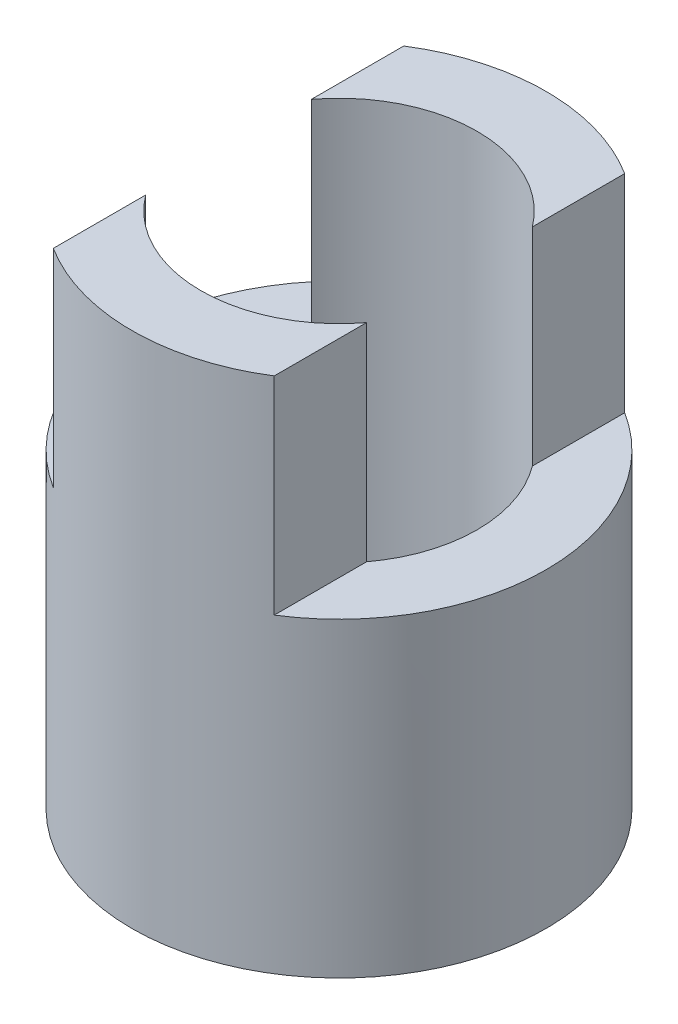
ISO-10303-21;
HEADER;
FILE_DESCRIPTION(('STEP AP214'),'2;1');
FILE_NAME('part.step','',(''),(''),'','','');
FILE_SCHEMA(('AUTOMOTIVE_DESIGN { 1 0 10303 214 1 1 1 1 }'));
ENDSEC;
DATA;
#1=APPLICATION_CONTEXT('core data for automotive mechanical design processes');
#2=APPLICATION_PROTOCOL_DEFINITION('international standard','automotive_design',2000,#1);
#3=PRODUCT_CONTEXT('',#1,'mechanical');
#4=PRODUCT('Part','Part','',(#3));
#5=PRODUCT_RELATED_PRODUCT_CATEGORY('part','',(#4));
#6=PRODUCT_DEFINITION_FORMATION('','',#4);
#7=PRODUCT_DEFINITION_CONTEXT('part definition',#1,'design');
#8=PRODUCT_DEFINITION('design','',#6,#7);
#9=PRODUCT_DEFINITION_SHAPE('','',#8);
#10=(LENGTH_UNIT() NAMED_UNIT(*) SI_UNIT(.MILLI.,.METRE.));
#11=(NAMED_UNIT(*) PLANE_ANGLE_UNIT() SI_UNIT($,.RADIAN.));
#12=(NAMED_UNIT(*) SI_UNIT($,.STERADIAN.) SOLID_ANGLE_UNIT());
#13=UNCERTAINTY_MEASURE_WITH_UNIT(LENGTH_MEASURE(1.E-05),#10,'distance_accuracy_value','');
#14=(GEOMETRIC_REPRESENTATION_CONTEXT(3) GLOBAL_UNCERTAINTY_ASSIGNED_CONTEXT((#13)) GLOBAL_UNIT_ASSIGNED_CONTEXT((#10,
#11,#12)) REPRESENTATION_CONTEXT('',''));
#15=CARTESIAN_POINT('',(0.,0.,0.));
#16=DIRECTION('',(0.,0.,1.));
#17=DIRECTION('',(1.,0.,0.));
#18=AXIS2_PLACEMENT_3D('',#15,#16,#17);
#19=CARTESIAN_POINT('',(0.,75.,0.));
#20=DIRECTION('',(0.,1.,0.));
#21=DIRECTION('',(0.,0.,1.));
#22=AXIS2_PLACEMENT_3D('',#19,#20,#21);
#23=PLANE('',#22);
#24=DIRECTION('',(0.,0.,1.));
#25=VECTOR('',#24,1.);
#26=CARTESIAN_POINT('',(16.,75.,-25.377155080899));
#27=LINE('',#26,#25);
#28=CARTESIAN_POINT('',(16.,75.,-25.377155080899));
#29=VERTEX_POINT('',#28);
#30=CARTESIAN_POINT('',(16.,75.,-12.));
#31=VERTEX_POINT('',#30);
#32=EDGE_CURVE('E101',#29,#31,#27,.T.);
#33=ORIENTED_EDGE('',*,*,#32,.F.);
#34=CARTESIAN_POINT('',(0.,75.,0.));
#35=DIRECTION('',(0.,1.,0.));
#36=DIRECTION('',(0.,0.,1.));
#37=AXIS2_PLACEMENT_3D('',#34,#35,#36);
#38=CIRCLE('',#37,30.);
#39=CARTESIAN_POINT('',(-16.,75.,-25.377155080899));
#40=VERTEX_POINT('',#39);
#41=EDGE_CURVE('E113',#29,#40,#38,.T.);
#42=ORIENTED_EDGE('',*,*,#41,.T.);
#43=DIRECTION('',(0.,0.,-1.));
#44=VECTOR('',#43,1.);
#45=CARTESIAN_POINT('',(-16.,75.,25.377155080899));
#46=LINE('',#45,#44);
#47=CARTESIAN_POINT('',(-16.,75.,-12.));
#48=VERTEX_POINT('',#47);
#49=EDGE_CURVE('E116',#48,#40,#46,.T.);
#50=ORIENTED_EDGE('',*,*,#49,.F.);
#51=CARTESIAN_POINT('',(0.,75.,0.));
#52=DIRECTION('',(0.,1.,0.));
#53=DIRECTION('',(0.,0.,1.));
#54=AXIS2_PLACEMENT_3D('',#51,#52,#53);
#55=CIRCLE('',#54,20.);
#56=EDGE_CURVE('E135',#31,#48,#55,.T.);
#57=ORIENTED_EDGE('',*,*,#56,.F.);
#58=EDGE_LOOP('',(#33,#42,#50,#57));
#59=FACE_BOUND('',#58,.T.);
#60=ADVANCED_FACE('F31',(#59),#23,.T.);
#61=CARTESIAN_POINT('',(16.,75.,12.));
#62=VERTEX_POINT('',#61);
#63=CARTESIAN_POINT('',(16.,75.,25.377155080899));
#64=VERTEX_POINT('',#63);
#65=EDGE_CURVE('E156',#62,#64,#27,.T.);
#66=ORIENTED_EDGE('',*,*,#65,.F.);
#67=CARTESIAN_POINT('',(-16.,75.,12.));
#68=VERTEX_POINT('',#67);
#69=EDGE_CURVE('E131',#68,#62,#55,.T.);
#70=ORIENTED_EDGE('',*,*,#69,.F.);
#71=CARTESIAN_POINT('',(-16.,75.,25.377155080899));
#72=VERTEX_POINT('',#71);
#73=EDGE_CURVE('E123',#72,#68,#46,.T.);
#74=ORIENTED_EDGE('',*,*,#73,.F.);
#75=EDGE_CURVE('E138',#72,#64,#38,.T.);
#76=ORIENTED_EDGE('',*,*,#75,.T.);
#77=EDGE_LOOP('',(#66,#70,#74,#76));
#78=FACE_BOUND('',#77,.T.);
#79=ADVANCED_FACE('F160',(#78),#23,.T.);
#80=CARTESIAN_POINT('',(0.,0.,0.));
#81=DIRECTION('',(0.,1.,0.));
#82=DIRECTION('',(0.,0.,1.));
#83=AXIS2_PLACEMENT_3D('',#80,#81,#82);
#84=PLANE('',#83);
#85=CARTESIAN_POINT('',(0.,0.,0.));
#86=DIRECTION('',(0.,1.,0.));
#87=DIRECTION('',(0.,0.,1.));
#88=AXIS2_PLACEMENT_3D('',#85,#86,#87);
#89=CIRCLE('',#88,30.);
#90=CARTESIAN_POINT('',(0.,0.,30.));
#91=VERTEX_POINT('',#90);
#92=EDGE_CURVE('E134',#91,#91,#89,.T.);
#93=ORIENTED_EDGE('',*,*,#92,.F.);
#94=EDGE_LOOP('',(#93));
#95=FACE_BOUND('',#94,.T.);
#96=CARTESIAN_POINT('',(0.,0.,0.));
#97=DIRECTION('',(0.,1.,0.));
#98=DIRECTION('',(0.,0.,1.));
#99=AXIS2_PLACEMENT_3D('',#96,#97,#98);
#100=CIRCLE('',#99,20.);
#101=CARTESIAN_POINT('',(0.,0.,20.));
#102=VERTEX_POINT('',#101);
#103=EDGE_CURVE('E129',#102,#102,#100,.T.);
#104=ORIENTED_EDGE('',*,*,#103,.T.);
#105=EDGE_LOOP('',(#104));
#106=FACE_BOUND('',#105,.T.);
#107=ADVANCED_FACE('F185',(#95,#106),#84,.F.);
#108=CARTESIAN_POINT('',(0.,75.,0.));
#109=DIRECTION('',(0.,-1.,0.));
#110=DIRECTION('',(0.,0.,-1.));
#111=AXIS2_PLACEMENT_3D('',#108,#109,#110);
#112=CYLINDRICAL_SURFACE('',#111,30.);
#113=ORIENTED_EDGE('',*,*,#41,.F.);
#114=DIRECTION('',(0.,1.,0.));
#115=VECTOR('',#114,1.);
#116=CARTESIAN_POINT('',(16.,45.,-25.377155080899));
#117=LINE('',#116,#115);
#118=CARTESIAN_POINT('',(16.,45.,-25.377155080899));
#119=VERTEX_POINT('',#118);
#120=EDGE_CURVE('E105',#119,#29,#117,.T.);
#121=ORIENTED_EDGE('',*,*,#120,.F.);
#122=CARTESIAN_POINT('',(0.,45.,0.));
#123=DIRECTION('',(0.,1.,0.));
#124=DIRECTION('',(0.,0.,1.));
#125=AXIS2_PLACEMENT_3D('',#122,#123,#124);
#126=CIRCLE('',#125,30.);
#127=CARTESIAN_POINT('',(16.,45.,25.377155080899));
#128=VERTEX_POINT('',#127);
#129=EDGE_CURVE('E93',#128,#119,#126,.T.);
#130=ORIENTED_EDGE('',*,*,#129,.F.);
#131=DIRECTION('',(0.,1.,0.));
#132=VECTOR('',#131,1.);
#133=CARTESIAN_POINT('',(16.,45.,25.377155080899));
#134=LINE('',#133,#132);
#135=EDGE_CURVE('E114',#128,#64,#134,.T.);
#136=ORIENTED_EDGE('',*,*,#135,.T.);
#137=ORIENTED_EDGE('',*,*,#75,.F.);
#138=DIRECTION('',(0.,1.,0.));
#139=VECTOR('',#138,1.);
#140=CARTESIAN_POINT('',(-16.,45.,25.377155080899));
#141=LINE('',#140,#139);
#142=CARTESIAN_POINT('',(-16.,45.,25.377155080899));
#143=VERTEX_POINT('',#142);
#144=EDGE_CURVE('E125',#143,#72,#141,.T.);
#145=ORIENTED_EDGE('',*,*,#144,.F.);
#146=CARTESIAN_POINT('',(0.,45.,0.));
#147=DIRECTION('',(0.,1.,0.));
#148=DIRECTION('',(0.,0.,1.));
#149=AXIS2_PLACEMENT_3D('',#146,#147,#148);
#150=CIRCLE('',#149,30.);
#151=CARTESIAN_POINT('',(-16.,45.,-25.377155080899));
#152=VERTEX_POINT('',#151);
#153=EDGE_CURVE('E120',#152,#143,#150,.T.);
#154=ORIENTED_EDGE('',*,*,#153,.F.);
#155=DIRECTION('',(0.,1.,0.));
#156=VECTOR('',#155,1.);
#157=CARTESIAN_POINT('',(-16.,45.,-25.377155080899));
#158=LINE('',#157,#156);
#159=EDGE_CURVE('E127',#152,#40,#158,.T.);
#160=ORIENTED_EDGE('',*,*,#159,.T.);
#161=EDGE_LOOP('',(#113,#121,#130,#136,#137,#145,#154,#160));
#162=FACE_BOUND('',#161,.T.);
#163=ORIENTED_EDGE('',*,*,#92,.T.);
#164=EDGE_LOOP('',(#163));
#165=FACE_BOUND('',#164,.T.);
#166=ADVANCED_FACE('F33',(#162,#165),#112,.T.);
#167=CARTESIAN_POINT('',(0.,75.,0.));
#168=DIRECTION('',(0.,-1.,0.));
#169=DIRECTION('',(0.,0.,-1.));
#170=AXIS2_PLACEMENT_3D('',#167,#168,#169);
#171=CYLINDRICAL_SURFACE('',#170,20.);
#172=DIRECTION('',(0.,-1.,0.));
#173=VECTOR('',#172,1.);
#174=CARTESIAN_POINT('',(16.,75.,-12.));
#175=LINE('',#174,#173);
#176=CARTESIAN_POINT('',(16.,45.,-12.));
#177=VERTEX_POINT('',#176);
#178=EDGE_CURVE('E11',#31,#177,#175,.T.);
#179=ORIENTED_EDGE('',*,*,#178,.F.);
#180=ORIENTED_EDGE('',*,*,#56,.T.);
#181=DIRECTION('',(0.,-1.,0.));
#182=VECTOR('',#181,1.);
#183=CARTESIAN_POINT('',(-16.,75.,-12.));
#184=LINE('',#183,#182);
#185=CARTESIAN_POINT('',(-16.,45.,-12.));
#186=VERTEX_POINT('',#185);
#187=EDGE_CURVE('E146',#186,#48,#184,.F.);
#188=ORIENTED_EDGE('',*,*,#187,.F.);
#189=CARTESIAN_POINT('',(0.,45.,0.));
#190=DIRECTION('',(0.,1.,0.));
#191=DIRECTION('',(0.,0.,1.));
#192=AXIS2_PLACEMENT_3D('',#189,#190,#191);
#193=CIRCLE('',#192,20.);
#194=CARTESIAN_POINT('',(-16.,45.,12.));
#195=VERTEX_POINT('',#194);
#196=EDGE_CURVE('E141',#186,#195,#193,.T.);
#197=ORIENTED_EDGE('',*,*,#196,.T.);
#198=DIRECTION('',(0.,-1.,0.));
#199=VECTOR('',#198,1.);
#200=CARTESIAN_POINT('',(-16.,75.,12.));
#201=LINE('',#200,#199);
#202=EDGE_CURVE('E149',#68,#195,#201,.T.);
#203=ORIENTED_EDGE('',*,*,#202,.F.);
#204=ORIENTED_EDGE('',*,*,#69,.T.);
#205=DIRECTION('',(0.,-1.,0.));
#206=VECTOR('',#205,1.);
#207=CARTESIAN_POINT('',(16.,75.,12.));
#208=LINE('',#207,#206);
#209=CARTESIAN_POINT('',(16.,45.,12.));
#210=VERTEX_POINT('',#209);
#211=EDGE_CURVE('E39',#210,#62,#208,.F.);
#212=ORIENTED_EDGE('',*,*,#211,.F.);
#213=CARTESIAN_POINT('',(0.,45.,0.));
#214=DIRECTION('',(0.,1.,0.));
#215=DIRECTION('',(0.,0.,1.));
#216=AXIS2_PLACEMENT_3D('',#213,#214,#215);
#217=CIRCLE('',#216,20.);
#218=EDGE_CURVE('E151',#210,#177,#217,.T.);
#219=ORIENTED_EDGE('',*,*,#218,.T.);
#220=EDGE_LOOP('',(#179,#180,#188,#197,#203,#204,#212,#219));
#221=FACE_BOUND('',#220,.T.);
#222=ORIENTED_EDGE('',*,*,#103,.F.);
#223=EDGE_LOOP('',(#222));
#224=FACE_BOUND('',#223,.T.);
#225=ADVANCED_FACE('F164',(#221,#224),#171,.F.);
#226=CARTESIAN_POINT('',(-16.,45.,25.377155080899));
#227=DIRECTION('',(1.,0.,0.));
#228=DIRECTION('',(0.,0.,-1.));
#229=AXIS2_PLACEMENT_3D('',#226,#227,#228);
#230=PLANE('',#229);
#231=ORIENTED_EDGE('',*,*,#202,.T.);
#232=DIRECTION('',(0.,0.,-1.));
#233=VECTOR('',#232,1.);
#234=CARTESIAN_POINT('',(-16.,45.,25.377155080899));
#235=LINE('',#234,#233);
#236=EDGE_CURVE('E53',#143,#195,#235,.T.);
#237=ORIENTED_EDGE('',*,*,#236,.F.);
#238=ORIENTED_EDGE('',*,*,#144,.T.);
#239=ORIENTED_EDGE('',*,*,#73,.T.);
#240=EDGE_LOOP('',(#231,#237,#238,#239));
#241=FACE_BOUND('',#240,.T.);
#242=ADVANCED_FACE('F168',(#241),#230,.F.);
#243=ORIENTED_EDGE('',*,*,#187,.T.);
#244=ORIENTED_EDGE('',*,*,#49,.T.);
#245=ORIENTED_EDGE('',*,*,#159,.F.);
#246=EDGE_CURVE('E122',#186,#152,#235,.T.);
#247=ORIENTED_EDGE('',*,*,#246,.F.);
#248=EDGE_LOOP('',(#243,#244,#245,#247));
#249=FACE_BOUND('',#248,.T.);
#250=ADVANCED_FACE('F176',(#249),#230,.F.);
#251=CARTESIAN_POINT('',(0.,45.,0.));
#252=DIRECTION('',(0.,1.,0.));
#253=DIRECTION('',(0.,0.,1.));
#254=AXIS2_PLACEMENT_3D('',#251,#252,#253);
#255=PLANE('',#254);
#256=ORIENTED_EDGE('',*,*,#246,.T.);
#257=ORIENTED_EDGE('',*,*,#153,.T.);
#258=ORIENTED_EDGE('',*,*,#236,.T.);
#259=ORIENTED_EDGE('',*,*,#196,.F.);
#260=EDGE_LOOP('',(#256,#257,#258,#259));
#261=FACE_BOUND('',#260,.T.);
#262=ADVANCED_FACE('F172',(#261),#255,.T.);
#263=CARTESIAN_POINT('',(16.,45.,-25.377155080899));
#264=DIRECTION('',(-1.,0.,0.));
#265=DIRECTION('',(0.,0.,1.));
#266=AXIS2_PLACEMENT_3D('',#263,#264,#265);
#267=PLANE('',#266);
#268=ORIENTED_EDGE('',*,*,#178,.T.);
#269=DIRECTION('',(0.,0.,1.));
#270=VECTOR('',#269,1.);
#271=CARTESIAN_POINT('',(16.,45.,-25.377155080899));
#272=LINE('',#271,#270);
#273=EDGE_CURVE('E46',#119,#177,#272,.T.);
#274=ORIENTED_EDGE('',*,*,#273,.F.);
#275=ORIENTED_EDGE('',*,*,#120,.T.);
#276=ORIENTED_EDGE('',*,*,#32,.T.);
#277=EDGE_LOOP('',(#268,#274,#275,#276));
#278=FACE_BOUND('',#277,.T.);
#279=ADVANCED_FACE('F104',(#278),#267,.F.);
#280=ORIENTED_EDGE('',*,*,#211,.T.);
#281=ORIENTED_EDGE('',*,*,#65,.T.);
#282=ORIENTED_EDGE('',*,*,#135,.F.);
#283=EDGE_CURVE('E96',#210,#128,#272,.T.);
#284=ORIENTED_EDGE('',*,*,#283,.F.);
#285=EDGE_LOOP('',(#280,#281,#282,#284));
#286=FACE_BOUND('',#285,.T.);
#287=ADVANCED_FACE('F155',(#286),#267,.F.);
#288=CARTESIAN_POINT('',(0.,45.,0.));
#289=DIRECTION('',(0.,1.,0.));
#290=DIRECTION('',(0.,0.,1.));
#291=AXIS2_PLACEMENT_3D('',#288,#289,#290);
#292=PLANE('',#291);
#293=ORIENTED_EDGE('',*,*,#283,.T.);
#294=ORIENTED_EDGE('',*,*,#129,.T.);
#295=ORIENTED_EDGE('',*,*,#273,.T.);
#296=ORIENTED_EDGE('',*,*,#218,.F.);
#297=EDGE_LOOP('',(#293,#294,#295,#296));
#298=FACE_BOUND('',#297,.T.);
#299=ADVANCED_FACE('F94',(#298),#292,.T.);
#300=CLOSED_SHELL('',(#60,#79,#107,#166,#225,#242,#250,#262,#279,#287,#299));
#301=MANIFOLD_SOLID_BREP('B2',#300);
#302=ADVANCED_BREP_SHAPE_REPRESENTATION('',(#18,#301),#14);
#303=SHAPE_DEFINITION_REPRESENTATION(#9,#302);
ENDSEC;
END-ISO-10303-21;
